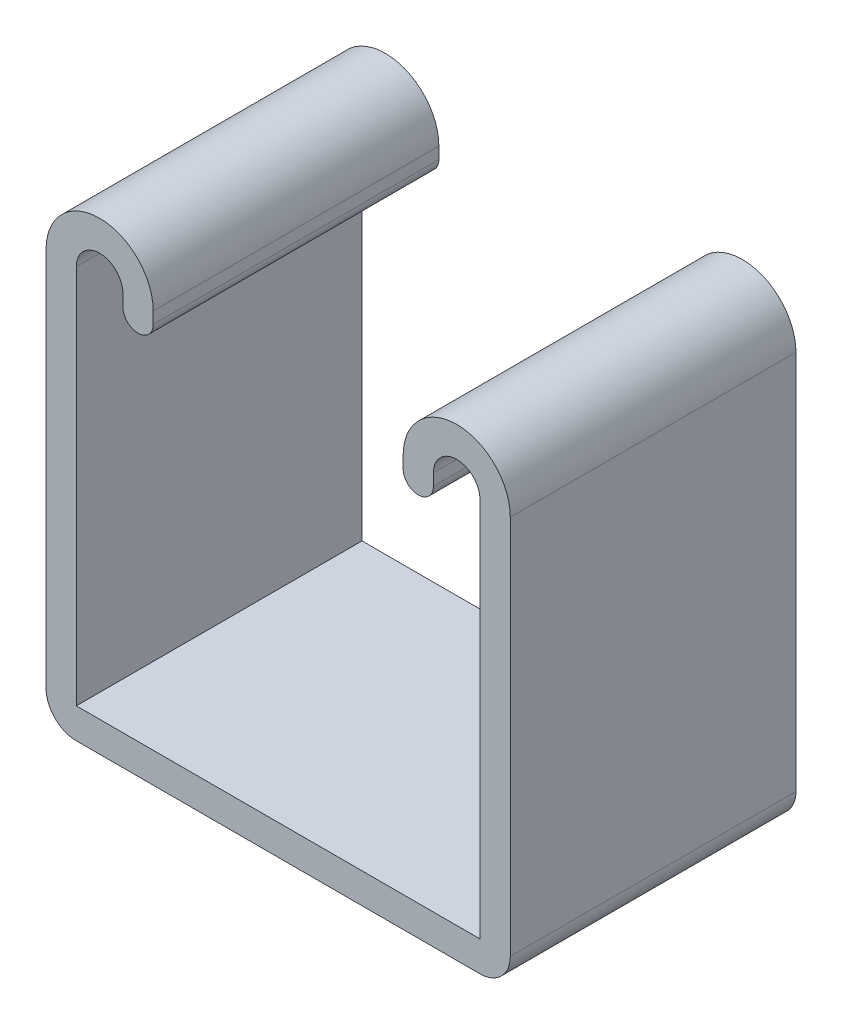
ISO-10303-21;
HEADER;
FILE_DESCRIPTION(('STEP AP214'),'2;1');
FILE_NAME('part.step','',(''),(''),'','','');
FILE_SCHEMA(('AUTOMOTIVE_DESIGN { 1 0 10303 214 1 1 1 1 }'));
ENDSEC;
DATA;
#1=APPLICATION_CONTEXT('core data for automotive mechanical design processes');
#2=APPLICATION_PROTOCOL_DEFINITION('international standard','automotive_design',2000,#1);
#3=PRODUCT_CONTEXT('',#1,'mechanical');
#4=PRODUCT('Part','Part','',(#3));
#5=PRODUCT_RELATED_PRODUCT_CATEGORY('part','',(#4));
#6=PRODUCT_DEFINITION_FORMATION('','',#4);
#7=PRODUCT_DEFINITION_CONTEXT('part definition',#1,'design');
#8=PRODUCT_DEFINITION('design','',#6,#7);
#9=PRODUCT_DEFINITION_SHAPE('','',#8);
#10=(LENGTH_UNIT() NAMED_UNIT(*) SI_UNIT(.MILLI.,.METRE.));
#11=(NAMED_UNIT(*) PLANE_ANGLE_UNIT() SI_UNIT($,.RADIAN.));
#12=(NAMED_UNIT(*) SI_UNIT($,.STERADIAN.) SOLID_ANGLE_UNIT());
#13=UNCERTAINTY_MEASURE_WITH_UNIT(LENGTH_MEASURE(1.E-05),#10,'distance_accuracy_value','');
#14=(GEOMETRIC_REPRESENTATION_CONTEXT(3) GLOBAL_UNCERTAINTY_ASSIGNED_CONTEXT((#13)) GLOBAL_UNIT_ASSIGNED_CONTEXT((#10,
#11,#12)) REPRESENTATION_CONTEXT('',''));
#15=CARTESIAN_POINT('',(0.,0.,0.));
#16=DIRECTION('',(0.,0.,1.));
#17=DIRECTION('',(1.,0.,0.));
#18=AXIS2_PLACEMENT_3D('',#15,#16,#17);
#19=CARTESIAN_POINT('',(-15.875,18.4785,12.7));
#20=DIRECTION('',(0.,0.,-1.));
#21=DIRECTION('',(-1.,0.,0.));
#22=AXIS2_PLACEMENT_3D('',#19,#20,#21);
#23=CYLINDRICAL_SURFACE('',#22,4.7625);
#24=CARTESIAN_POINT('',(-15.875,18.4785,-12.7));
#25=DIRECTION('',(0.,0.,1.));
#26=DIRECTION('',(-1.,0.,0.));
#27=AXIS2_PLACEMENT_3D('',#24,#25,#26);
#28=CIRCLE('',#27,4.7625);
#29=CARTESIAN_POINT('',(-11.1125,18.4785,-12.7));
#30=VERTEX_POINT('',#29);
#31=CARTESIAN_POINT('',(-20.6375,18.4785,-12.7));
#32=VERTEX_POINT('',#31);
#33=EDGE_CURVE('E189',#30,#32,#28,.T.);
#34=ORIENTED_EDGE('',*,*,#33,.T.);
#35=DIRECTION('',(0.,0.,-1.));
#36=VECTOR('',#35,1.);
#37=CARTESIAN_POINT('',(-20.6375,18.4785,12.7));
#38=LINE('',#37,#36);
#39=CARTESIAN_POINT('',(-20.6375,18.4785,12.7));
#40=VERTEX_POINT('',#39);
#41=EDGE_CURVE('E11',#40,#32,#38,.T.);
#42=ORIENTED_EDGE('',*,*,#41,.F.);
#43=CARTESIAN_POINT('',(-15.875,18.4785,12.7));
#44=DIRECTION('',(0.,0.,1.));
#45=DIRECTION('',(-1.,0.,0.));
#46=AXIS2_PLACEMENT_3D('',#43,#44,#45);
#47=CIRCLE('',#46,4.7625);
#48=CARTESIAN_POINT('',(-11.1125,18.4785,12.7));
#49=VERTEX_POINT('',#48);
#50=EDGE_CURVE('E223',#49,#40,#47,.T.);
#51=ORIENTED_EDGE('',*,*,#50,.F.);
#52=DIRECTION('',(0.,0.,-1.));
#53=VECTOR('',#52,1.);
#54=CARTESIAN_POINT('',(-11.1125,18.4785,12.7));
#55=LINE('',#54,#53);
#56=EDGE_CURVE('E185',#49,#30,#55,.T.);
#57=ORIENTED_EDGE('',*,*,#56,.T.);
#58=EDGE_LOOP('',(#34,#42,#51,#57));
#59=FACE_BOUND('',#58,.T.);
#60=ADVANCED_FACE('F33',(#59),#23,.T.);
#61=CARTESIAN_POINT('',(-20.6375,18.4785,12.7));
#62=DIRECTION('',(1.,0.,0.));
#63=DIRECTION('',(0.,1.,0.));
#64=AXIS2_PLACEMENT_3D('',#61,#62,#63);
#65=PLANE('',#64);
#66=DIRECTION('',(0.,-1.,0.));
#67=VECTOR('',#66,1.);
#68=CARTESIAN_POINT('',(-20.6375,18.4785,-12.7));
#69=LINE('',#68,#67);
#70=CARTESIAN_POINT('',(-20.6375,-15.3416,-12.7));
#71=VERTEX_POINT('',#70);
#72=EDGE_CURVE('E192',#32,#71,#69,.T.);
#73=ORIENTED_EDGE('',*,*,#72,.T.);
#74=DIRECTION('',(0.,0.,-1.));
#75=VECTOR('',#74,1.);
#76=CARTESIAN_POINT('',(-20.6375,-15.3416,12.7));
#77=LINE('',#76,#75);
#78=CARTESIAN_POINT('',(-20.6375,-15.3416,12.7));
#79=VERTEX_POINT('',#78);
#80=EDGE_CURVE('E41',#79,#71,#77,.T.);
#81=ORIENTED_EDGE('',*,*,#80,.F.);
#82=DIRECTION('',(0.,-1.,0.));
#83=VECTOR('',#82,1.);
#84=CARTESIAN_POINT('',(-20.6375,18.4785,12.7));
#85=LINE('',#84,#83);
#86=EDGE_CURVE('E122',#40,#79,#85,.T.);
#87=ORIENTED_EDGE('',*,*,#86,.F.);
#88=ORIENTED_EDGE('',*,*,#41,.T.);
#89=EDGE_LOOP('',(#73,#81,#87,#88));
#90=FACE_BOUND('',#89,.T.);
#91=ADVANCED_FACE('F331',(#90),#65,.F.);
#92=CARTESIAN_POINT('',(-17.9451,-15.3416,12.7));
#93=DIRECTION('',(0.,0.,-1.));
#94=DIRECTION('',(-1.,0.,0.));
#95=AXIS2_PLACEMENT_3D('',#92,#93,#94);
#96=CYLINDRICAL_SURFACE('',#95,2.6924);
#97=CARTESIAN_POINT('',(-17.9451,-15.3416,-12.7));
#98=DIRECTION('',(0.,0.,1.));
#99=DIRECTION('',(-1.,0.,0.));
#100=AXIS2_PLACEMENT_3D('',#97,#98,#99);
#101=CIRCLE('',#100,2.6924);
#102=CARTESIAN_POINT('',(-17.9451,-18.034,-12.7));
#103=VERTEX_POINT('',#102);
#104=EDGE_CURVE('E194',#71,#103,#101,.T.);
#105=ORIENTED_EDGE('',*,*,#104,.T.);
#106=DIRECTION('',(0.,0.,-1.));
#107=VECTOR('',#106,1.);
#108=CARTESIAN_POINT('',(-17.9451,-18.034,12.7));
#109=LINE('',#108,#107);
#110=CARTESIAN_POINT('',(-17.9451,-18.034,12.7));
#111=VERTEX_POINT('',#110);
#112=EDGE_CURVE('E260',#111,#103,#109,.T.);
#113=ORIENTED_EDGE('',*,*,#112,.F.);
#114=CARTESIAN_POINT('',(-17.9451,-15.3416,12.7));
#115=DIRECTION('',(0.,0.,1.));
#116=DIRECTION('',(-1.,0.,0.));
#117=AXIS2_PLACEMENT_3D('',#114,#115,#116);
#118=CIRCLE('',#117,2.6924);
#119=EDGE_CURVE('E268',#79,#111,#118,.T.);
#120=ORIENTED_EDGE('',*,*,#119,.F.);
#121=ORIENTED_EDGE('',*,*,#80,.T.);
#122=EDGE_LOOP('',(#105,#113,#120,#121));
#123=FACE_BOUND('',#122,.T.);
#124=ADVANCED_FACE('F266',(#123),#96,.T.);
#125=CARTESIAN_POINT('',(-17.9451,-18.034,12.7));
#126=DIRECTION('',(0.,1.,0.));
#127=DIRECTION('',(-1.,0.,0.));
#128=AXIS2_PLACEMENT_3D('',#125,#126,#127);
#129=PLANE('',#128);
#130=DIRECTION('',(1.,0.,0.));
#131=VECTOR('',#130,1.);
#132=CARTESIAN_POINT('',(-17.9451,-18.034,-12.7));
#133=LINE('',#132,#131);
#134=CARTESIAN_POINT('',(17.9451,-18.034,-12.7));
#135=VERTEX_POINT('',#134);
#136=EDGE_CURVE('E196',#103,#135,#133,.T.);
#137=ORIENTED_EDGE('',*,*,#136,.T.);
#138=DIRECTION('',(0.,0.,-1.));
#139=VECTOR('',#138,1.);
#140=CARTESIAN_POINT('',(17.9451,-18.034,12.7));
#141=LINE('',#140,#139);
#142=CARTESIAN_POINT('',(17.9451,-18.034,12.7));
#143=VERTEX_POINT('',#142);
#144=EDGE_CURVE('E257',#143,#135,#141,.T.);
#145=ORIENTED_EDGE('',*,*,#144,.F.);
#146=DIRECTION('',(1.,0.,0.));
#147=VECTOR('',#146,1.);
#148=CARTESIAN_POINT('',(-17.9451,-18.034,12.7));
#149=LINE('',#148,#147);
#150=EDGE_CURVE('E286',#111,#143,#149,.T.);
#151=ORIENTED_EDGE('',*,*,#150,.F.);
#152=ORIENTED_EDGE('',*,*,#112,.T.);
#153=EDGE_LOOP('',(#137,#145,#151,#152));
#154=FACE_BOUND('',#153,.T.);
#155=ADVANCED_FACE('F277',(#154),#129,.F.);
#156=CARTESIAN_POINT('',(17.9451,-15.3416,12.7));
#157=DIRECTION('',(0.,0.,-1.));
#158=DIRECTION('',(-1.,0.,0.));
#159=AXIS2_PLACEMENT_3D('',#156,#157,#158);
#160=CYLINDRICAL_SURFACE('',#159,2.6924);
#161=CARTESIAN_POINT('',(17.9451,-15.3416,-12.7));
#162=DIRECTION('',(0.,0.,1.));
#163=DIRECTION('',(1.,0.,0.));
#164=AXIS2_PLACEMENT_3D('',#161,#162,#163);
#165=CIRCLE('',#164,2.6924);
#166=CARTESIAN_POINT('',(20.6375,-15.3416,-12.7));
#167=VERTEX_POINT('',#166);
#168=EDGE_CURVE('E198',#135,#167,#165,.T.);
#169=ORIENTED_EDGE('',*,*,#168,.T.);
#170=DIRECTION('',(0.,0.,-1.));
#171=VECTOR('',#170,1.);
#172=CARTESIAN_POINT('',(20.6375,-15.3416,12.7));
#173=LINE('',#172,#171);
#174=CARTESIAN_POINT('',(20.6375,-15.3416,12.7));
#175=VERTEX_POINT('',#174);
#176=EDGE_CURVE('E254',#175,#167,#173,.T.);
#177=ORIENTED_EDGE('',*,*,#176,.F.);
#178=CARTESIAN_POINT('',(17.9451,-15.3416,12.7));
#179=DIRECTION('',(0.,0.,1.));
#180=DIRECTION('',(1.,0.,0.));
#181=AXIS2_PLACEMENT_3D('',#178,#179,#180);
#182=CIRCLE('',#181,2.6924);
#183=EDGE_CURVE('E283',#143,#175,#182,.T.);
#184=ORIENTED_EDGE('',*,*,#183,.F.);
#185=ORIENTED_EDGE('',*,*,#144,.T.);
#186=EDGE_LOOP('',(#169,#177,#184,#185));
#187=FACE_BOUND('',#186,.T.);
#188=ADVANCED_FACE('F281',(#187),#160,.T.);
#189=CARTESIAN_POINT('',(20.6375,-15.3416,12.7));
#190=DIRECTION('',(-1.,0.,0.));
#191=DIRECTION('',(0.,0.,1.));
#192=AXIS2_PLACEMENT_3D('',#189,#190,#191);
#193=PLANE('',#192);
#194=DIRECTION('',(0.,1.,0.));
#195=VECTOR('',#194,1.);
#196=CARTESIAN_POINT('',(20.6375,-15.3416,-12.7));
#197=LINE('',#196,#195);
#198=CARTESIAN_POINT('',(20.6375,18.4785,-12.7));
#199=VERTEX_POINT('',#198);
#200=EDGE_CURVE('E200',#167,#199,#197,.T.);
#201=ORIENTED_EDGE('',*,*,#200,.T.);
#202=DIRECTION('',(0.,0.,-1.));
#203=VECTOR('',#202,1.);
#204=CARTESIAN_POINT('',(20.6375,18.4785,12.7));
#205=LINE('',#204,#203);
#206=CARTESIAN_POINT('',(20.6375,18.4785,12.7));
#207=VERTEX_POINT('',#206);
#208=EDGE_CURVE('E251',#207,#199,#205,.T.);
#209=ORIENTED_EDGE('',*,*,#208,.F.);
#210=DIRECTION('',(0.,1.,0.));
#211=VECTOR('',#210,1.);
#212=CARTESIAN_POINT('',(20.6375,-15.3416,12.7));
#213=LINE('',#212,#211);
#214=EDGE_CURVE('E285',#175,#207,#213,.T.);
#215=ORIENTED_EDGE('',*,*,#214,.F.);
#216=ORIENTED_EDGE('',*,*,#176,.T.);
#217=EDGE_LOOP('',(#201,#209,#215,#216));
#218=FACE_BOUND('',#217,.T.);
#219=ADVANCED_FACE('F344',(#218),#193,.F.);
#220=CARTESIAN_POINT('',(15.875,18.4785,12.7));
#221=DIRECTION('',(0.,0.,-1.));
#222=DIRECTION('',(-1.,0.,0.));
#223=AXIS2_PLACEMENT_3D('',#220,#221,#222);
#224=CYLINDRICAL_SURFACE('',#223,4.7625);
#225=CARTESIAN_POINT('',(15.875,18.4785,-12.7));
#226=DIRECTION('',(0.,0.,1.));
#227=DIRECTION('',(1.,0.,0.));
#228=AXIS2_PLACEMENT_3D('',#225,#226,#227);
#229=CIRCLE('',#228,4.7625);
#230=CARTESIAN_POINT('',(11.1125,18.4785,-12.7));
#231=VERTEX_POINT('',#230);
#232=EDGE_CURVE('E202',#199,#231,#229,.T.);
#233=ORIENTED_EDGE('',*,*,#232,.T.);
#234=DIRECTION('',(0.,0.,-1.));
#235=VECTOR('',#234,1.);
#236=CARTESIAN_POINT('',(11.1125,18.4785,12.7));
#237=LINE('',#236,#235);
#238=CARTESIAN_POINT('',(11.1125,18.4785,12.7));
#239=VERTEX_POINT('',#238);
#240=EDGE_CURVE('E248',#239,#231,#237,.T.);
#241=ORIENTED_EDGE('',*,*,#240,.F.);
#242=CARTESIAN_POINT('',(15.875,18.4785,12.7));
#243=DIRECTION('',(0.,0.,1.));
#244=DIRECTION('',(1.,0.,0.));
#245=AXIS2_PLACEMENT_3D('',#242,#243,#244);
#246=CIRCLE('',#245,4.7625);
#247=EDGE_CURVE('E288',#207,#239,#246,.T.);
#248=ORIENTED_EDGE('',*,*,#247,.F.);
#249=ORIENTED_EDGE('',*,*,#208,.T.);
#250=EDGE_LOOP('',(#233,#241,#248,#249));
#251=FACE_BOUND('',#250,.T.);
#252=ADVANCED_FACE('F347',(#251),#224,.T.);
#253=CARTESIAN_POINT('',(11.1125,18.4785,12.7));
#254=DIRECTION('',(1.,0.,0.));
#255=DIRECTION('',(0.,1.,0.));
#256=AXIS2_PLACEMENT_3D('',#253,#254,#255);
#257=PLANE('',#256);
#258=DIRECTION('',(0.,-1.,0.));
#259=VECTOR('',#258,1.);
#260=CARTESIAN_POINT('',(11.1125,18.4785,-12.7));
#261=LINE('',#260,#259);
#262=CARTESIAN_POINT('',(11.1125,17.44345,-12.7));
#263=VERTEX_POINT('',#262);
#264=EDGE_CURVE('E204',#231,#263,#261,.T.);
#265=ORIENTED_EDGE('',*,*,#264,.T.);
#266=DIRECTION('',(0.,0.,-1.));
#267=VECTOR('',#266,1.);
#268=CARTESIAN_POINT('',(11.1125,17.44345,12.7));
#269=LINE('',#268,#267);
#270=CARTESIAN_POINT('',(11.1125,17.44345,12.7));
#271=VERTEX_POINT('',#270);
#272=EDGE_CURVE('E245',#271,#263,#269,.T.);
#273=ORIENTED_EDGE('',*,*,#272,.F.);
#274=DIRECTION('',(0.,-1.,0.));
#275=VECTOR('',#274,1.);
#276=CARTESIAN_POINT('',(11.1125,18.4785,12.7));
#277=LINE('',#276,#275);
#278=EDGE_CURVE('E294',#239,#271,#277,.T.);
#279=ORIENTED_EDGE('',*,*,#278,.F.);
#280=ORIENTED_EDGE('',*,*,#240,.T.);
#281=EDGE_LOOP('',(#265,#273,#279,#280));
#282=FACE_BOUND('',#281,.T.);
#283=ADVANCED_FACE('F351',(#282),#257,.F.);
#284=CARTESIAN_POINT('',(12.4587,17.44345,12.7));
#285=DIRECTION('',(0.,0.,-1.));
#286=DIRECTION('',(-1.,0.,0.));
#287=AXIS2_PLACEMENT_3D('',#284,#285,#286);
#288=CYLINDRICAL_SURFACE('',#287,1.3462);
#289=CARTESIAN_POINT('',(12.4587,17.44345,-12.7));
#290=DIRECTION('',(0.,0.,1.));
#291=DIRECTION('',(1.,0.,0.));
#292=AXIS2_PLACEMENT_3D('',#289,#290,#291);
#293=CIRCLE('',#292,1.3462);
#294=CARTESIAN_POINT('',(13.8049,17.44345,-12.7));
#295=VERTEX_POINT('',#294);
#296=EDGE_CURVE('E206',#263,#295,#293,.T.);
#297=ORIENTED_EDGE('',*,*,#296,.T.);
#298=DIRECTION('',(0.,0.,-1.));
#299=VECTOR('',#298,1.);
#300=CARTESIAN_POINT('',(13.8049,17.44345,12.7));
#301=LINE('',#300,#299);
#302=CARTESIAN_POINT('',(13.8049,17.44345,12.7));
#303=VERTEX_POINT('',#302);
#304=EDGE_CURVE('E242',#303,#295,#301,.T.);
#305=ORIENTED_EDGE('',*,*,#304,.F.);
#306=CARTESIAN_POINT('',(12.4587,17.44345,12.7));
#307=DIRECTION('',(0.,0.,1.));
#308=DIRECTION('',(1.,0.,0.));
#309=AXIS2_PLACEMENT_3D('',#306,#307,#308);
#310=CIRCLE('',#309,1.3462);
#311=EDGE_CURVE('E296',#271,#303,#310,.T.);
#312=ORIENTED_EDGE('',*,*,#311,.F.);
#313=ORIENTED_EDGE('',*,*,#272,.T.);
#314=EDGE_LOOP('',(#297,#305,#312,#313));
#315=FACE_BOUND('',#314,.T.);
#316=ADVANCED_FACE('F355',(#315),#288,.T.);
#317=CARTESIAN_POINT('',(13.8049,18.4785,12.7));
#318=DIRECTION('',(-1.,0.,0.));
#319=DIRECTION('',(0.,0.,1.));
#320=AXIS2_PLACEMENT_3D('',#317,#318,#319);
#321=PLANE('',#320);
#322=DIRECTION('',(0.,1.,0.));
#323=VECTOR('',#322,1.);
#324=CARTESIAN_POINT('',(13.8049,18.4785,-12.7));
#325=LINE('',#324,#323);
#326=CARTESIAN_POINT('',(13.8049,18.4785,-12.7));
#327=VERTEX_POINT('',#326);
#328=EDGE_CURVE('E208',#295,#327,#325,.T.);
#329=ORIENTED_EDGE('',*,*,#328,.T.);
#330=DIRECTION('',(0.,0.,-1.));
#331=VECTOR('',#330,1.);
#332=CARTESIAN_POINT('',(13.8049,18.4785,12.7));
#333=LINE('',#332,#331);
#334=CARTESIAN_POINT('',(13.8049,18.4785,12.7));
#335=VERTEX_POINT('',#334);
#336=EDGE_CURVE('E239',#335,#327,#333,.T.);
#337=ORIENTED_EDGE('',*,*,#336,.F.);
#338=DIRECTION('',(0.,1.,0.));
#339=VECTOR('',#338,1.);
#340=CARTESIAN_POINT('',(13.8049,18.4785,12.7));
#341=LINE('',#340,#339);
#342=EDGE_CURVE('E298',#303,#335,#341,.T.);
#343=ORIENTED_EDGE('',*,*,#342,.F.);
#344=ORIENTED_EDGE('',*,*,#304,.T.);
#345=EDGE_LOOP('',(#329,#337,#343,#344));
#346=FACE_BOUND('',#345,.T.);
#347=ADVANCED_FACE('F359',(#346),#321,.F.);
#348=CARTESIAN_POINT('',(15.875,18.4785,12.7));
#349=DIRECTION('',(0.,0.,-1.));
#350=DIRECTION('',(-1.,0.,0.));
#351=AXIS2_PLACEMENT_3D('',#348,#349,#350);
#352=CYLINDRICAL_SURFACE('',#351,2.0701);
#353=CARTESIAN_POINT('',(15.875,18.4785,-12.7));
#354=DIRECTION('',(0.,0.,-1.));
#355=DIRECTION('',(1.,0.,0.));
#356=AXIS2_PLACEMENT_3D('',#353,#354,#355);
#357=CIRCLE('',#356,2.0701);
#358=CARTESIAN_POINT('',(17.9451,18.4785,-12.7));
#359=VERTEX_POINT('',#358);
#360=EDGE_CURVE('E210',#327,#359,#357,.T.);
#361=ORIENTED_EDGE('',*,*,#360,.T.);
#362=DIRECTION('',(0.,0.,-1.));
#363=VECTOR('',#362,1.);
#364=CARTESIAN_POINT('',(17.9451,18.4785,12.7));
#365=LINE('',#364,#363);
#366=CARTESIAN_POINT('',(17.9451,18.4785,12.7));
#367=VERTEX_POINT('',#366);
#368=EDGE_CURVE('E236',#367,#359,#365,.T.);
#369=ORIENTED_EDGE('',*,*,#368,.F.);
#370=CARTESIAN_POINT('',(15.875,18.4785,12.7));
#371=DIRECTION('',(0.,0.,-1.));
#372=DIRECTION('',(1.,0.,0.));
#373=AXIS2_PLACEMENT_3D('',#370,#371,#372);
#374=CIRCLE('',#373,2.0701);
#375=EDGE_CURVE('E300',#335,#367,#374,.T.);
#376=ORIENTED_EDGE('',*,*,#375,.F.);
#377=ORIENTED_EDGE('',*,*,#336,.T.);
#378=EDGE_LOOP('',(#361,#369,#376,#377));
#379=FACE_BOUND('',#378,.T.);
#380=ADVANCED_FACE('F363',(#379),#352,.F.);
#381=CARTESIAN_POINT('',(17.9451,-15.3416,12.7));
#382=DIRECTION('',(1.,0.,0.));
#383=DIRECTION('',(0.,1.,0.));
#384=AXIS2_PLACEMENT_3D('',#381,#382,#383);
#385=PLANE('',#384);
#386=DIRECTION('',(0.,-1.,0.));
#387=VECTOR('',#386,1.);
#388=CARTESIAN_POINT('',(17.9451,-15.3416,-12.7));
#389=LINE('',#388,#387);
#390=CARTESIAN_POINT('',(17.9451,-15.3416,-12.7));
#391=VERTEX_POINT('',#390);
#392=EDGE_CURVE('E212',#359,#391,#389,.T.);
#393=ORIENTED_EDGE('',*,*,#392,.T.);
#394=DIRECTION('',(0.,0.,-1.));
#395=VECTOR('',#394,1.);
#396=CARTESIAN_POINT('',(17.9451,-15.3416,12.7));
#397=LINE('',#396,#395);
#398=CARTESIAN_POINT('',(17.9451,-15.3416,12.7));
#399=VERTEX_POINT('',#398);
#400=EDGE_CURVE('E233',#399,#391,#397,.T.);
#401=ORIENTED_EDGE('',*,*,#400,.F.);
#402=DIRECTION('',(0.,-1.,0.));
#403=VECTOR('',#402,1.);
#404=CARTESIAN_POINT('',(17.9451,-15.3416,12.7));
#405=LINE('',#404,#403);
#406=EDGE_CURVE('E302',#367,#399,#405,.T.);
#407=ORIENTED_EDGE('',*,*,#406,.F.);
#408=ORIENTED_EDGE('',*,*,#368,.T.);
#409=EDGE_LOOP('',(#393,#401,#407,#408));
#410=FACE_BOUND('',#409,.T.);
#411=ADVANCED_FACE('F367',(#410),#385,.F.);
#412=CARTESIAN_POINT('',(-17.9451,-15.3416,12.7));
#413=DIRECTION('',(0.,-1.,0.));
#414=DIRECTION('',(1.,0.,0.));
#415=AXIS2_PLACEMENT_3D('',#412,#413,#414);
#416=PLANE('',#415);
#417=DIRECTION('',(-1.,0.,0.));
#418=VECTOR('',#417,1.);
#419=CARTESIAN_POINT('',(-17.9451,-15.3416,-12.7));
#420=LINE('',#419,#418);
#421=CARTESIAN_POINT('',(-17.9451,-15.3416,-12.7));
#422=VERTEX_POINT('',#421);
#423=EDGE_CURVE('E214',#391,#422,#420,.T.);
#424=ORIENTED_EDGE('',*,*,#423,.T.);
#425=DIRECTION('',(0.,0.,-1.));
#426=VECTOR('',#425,1.);
#427=CARTESIAN_POINT('',(-17.9451,-15.3416,12.7));
#428=LINE('',#427,#426);
#429=CARTESIAN_POINT('',(-17.9451,-15.3416,12.7));
#430=VERTEX_POINT('',#429);
#431=EDGE_CURVE('E230',#430,#422,#428,.T.);
#432=ORIENTED_EDGE('',*,*,#431,.F.);
#433=DIRECTION('',(-1.,0.,0.));
#434=VECTOR('',#433,1.);
#435=CARTESIAN_POINT('',(-17.9451,-15.3416,12.7));
#436=LINE('',#435,#434);
#437=EDGE_CURVE('E304',#399,#430,#436,.T.);
#438=ORIENTED_EDGE('',*,*,#437,.F.);
#439=ORIENTED_EDGE('',*,*,#400,.T.);
#440=EDGE_LOOP('',(#424,#432,#438,#439));
#441=FACE_BOUND('',#440,.T.);
#442=ADVANCED_FACE('F371',(#441),#416,.F.);
#443=CARTESIAN_POINT('',(-17.9451,18.4785,12.7));
#444=DIRECTION('',(-1.,0.,0.));
#445=DIRECTION('',(0.,-1.,0.));
#446=AXIS2_PLACEMENT_3D('',#443,#444,#445);
#447=PLANE('',#446);
#448=DIRECTION('',(0.,1.,0.));
#449=VECTOR('',#448,1.);
#450=CARTESIAN_POINT('',(-17.9451,18.4785,-12.7));
#451=LINE('',#450,#449);
#452=CARTESIAN_POINT('',(-17.9451,18.4785,-12.7));
#453=VERTEX_POINT('',#452);
#454=EDGE_CURVE('E216',#422,#453,#451,.T.);
#455=ORIENTED_EDGE('',*,*,#454,.T.);
#456=DIRECTION('',(0.,0.,-1.));
#457=VECTOR('',#456,1.);
#458=CARTESIAN_POINT('',(-17.9451,18.4785,12.7));
#459=LINE('',#458,#457);
#460=CARTESIAN_POINT('',(-17.9451,18.4785,12.7));
#461=VERTEX_POINT('',#460);
#462=EDGE_CURVE('E227',#461,#453,#459,.T.);
#463=ORIENTED_EDGE('',*,*,#462,.F.);
#464=DIRECTION('',(0.,1.,0.));
#465=VECTOR('',#464,1.);
#466=CARTESIAN_POINT('',(-17.9451,18.4785,12.7));
#467=LINE('',#466,#465);
#468=EDGE_CURVE('E306',#430,#461,#467,.T.);
#469=ORIENTED_EDGE('',*,*,#468,.F.);
#470=ORIENTED_EDGE('',*,*,#431,.T.);
#471=EDGE_LOOP('',(#455,#463,#469,#470));
#472=FACE_BOUND('',#471,.T.);
#473=ADVANCED_FACE('F312',(#472),#447,.F.);
#474=CARTESIAN_POINT('',(-15.875,18.4785,12.7));
#475=DIRECTION('',(0.,0.,-1.));
#476=DIRECTION('',(-1.,0.,0.));
#477=AXIS2_PLACEMENT_3D('',#474,#475,#476);
#478=CYLINDRICAL_SURFACE('',#477,2.0701);
#479=CARTESIAN_POINT('',(-15.875,18.4785,-12.7));
#480=DIRECTION('',(0.,0.,-1.));
#481=DIRECTION('',(-1.,0.,0.));
#482=AXIS2_PLACEMENT_3D('',#479,#480,#481);
#483=CIRCLE('',#482,2.0701);
#484=CARTESIAN_POINT('',(-13.8049,18.4785,-12.7));
#485=VERTEX_POINT('',#484);
#486=EDGE_CURVE('E218',#453,#485,#483,.T.);
#487=ORIENTED_EDGE('',*,*,#486,.T.);
#488=DIRECTION('',(0.,0.,-1.));
#489=VECTOR('',#488,1.);
#490=CARTESIAN_POINT('',(-13.8049,18.4785,12.7));
#491=LINE('',#490,#489);
#492=CARTESIAN_POINT('',(-13.8049,18.4785,12.7));
#493=VERTEX_POINT('',#492);
#494=EDGE_CURVE('E180',#493,#485,#491,.T.);
#495=ORIENTED_EDGE('',*,*,#494,.F.);
#496=CARTESIAN_POINT('',(-15.875,18.4785,12.7));
#497=DIRECTION('',(0.,0.,-1.));
#498=DIRECTION('',(-1.,0.,0.));
#499=AXIS2_PLACEMENT_3D('',#496,#497,#498);
#500=CIRCLE('',#499,2.0701);
#501=EDGE_CURVE('E171',#461,#493,#500,.T.);
#502=ORIENTED_EDGE('',*,*,#501,.F.);
#503=ORIENTED_EDGE('',*,*,#462,.T.);
#504=EDGE_LOOP('',(#487,#495,#502,#503));
#505=FACE_BOUND('',#504,.T.);
#506=ADVANCED_FACE('F316',(#505),#478,.F.);
#507=CARTESIAN_POINT('',(-13.8049,18.4785,12.7));
#508=DIRECTION('',(1.,0.,0.));
#509=DIRECTION('',(0.,1.,0.));
#510=AXIS2_PLACEMENT_3D('',#507,#508,#509);
#511=PLANE('',#510);
#512=DIRECTION('',(0.,-1.,0.));
#513=VECTOR('',#512,1.);
#514=CARTESIAN_POINT('',(-13.8049,18.4785,-12.7));
#515=LINE('',#514,#513);
#516=CARTESIAN_POINT('',(-13.8049,17.44345,-12.7));
#517=VERTEX_POINT('',#516);
#518=EDGE_CURVE('E179',#485,#517,#515,.T.);
#519=ORIENTED_EDGE('',*,*,#518,.T.);
#520=DIRECTION('',(0.,0.,-1.));
#521=VECTOR('',#520,1.);
#522=CARTESIAN_POINT('',(-13.8049,17.44345,12.7));
#523=LINE('',#522,#521);
#524=CARTESIAN_POINT('',(-13.8049,17.44345,12.7));
#525=VERTEX_POINT('',#524);
#526=EDGE_CURVE('E176',#525,#517,#523,.T.);
#527=ORIENTED_EDGE('',*,*,#526,.F.);
#528=DIRECTION('',(0.,-1.,0.));
#529=VECTOR('',#528,1.);
#530=CARTESIAN_POINT('',(-13.8049,18.4785,12.7));
#531=LINE('',#530,#529);
#532=EDGE_CURVE('E165',#493,#525,#531,.T.);
#533=ORIENTED_EDGE('',*,*,#532,.F.);
#534=ORIENTED_EDGE('',*,*,#494,.T.);
#535=EDGE_LOOP('',(#519,#527,#533,#534));
#536=FACE_BOUND('',#535,.T.);
#537=ADVANCED_FACE('F177',(#536),#511,.F.);
#538=CARTESIAN_POINT('',(-12.4587,17.44345,12.7));
#539=DIRECTION('',(0.,0.,-1.));
#540=DIRECTION('',(-1.,0.,0.));
#541=AXIS2_PLACEMENT_3D('',#538,#539,#540);
#542=CYLINDRICAL_SURFACE('',#541,1.3462);
#543=CARTESIAN_POINT('',(-12.4587,17.44345,-12.7));
#544=DIRECTION('',(0.,0.,1.));
#545=DIRECTION('',(-1.,0.,0.));
#546=AXIS2_PLACEMENT_3D('',#543,#544,#545);
#547=CIRCLE('',#546,1.3462);
#548=CARTESIAN_POINT('',(-11.1125,17.44345,-12.7));
#549=VERTEX_POINT('',#548);
#550=EDGE_CURVE('E108',#517,#549,#547,.T.);
#551=ORIENTED_EDGE('',*,*,#550,.T.);
#552=DIRECTION('',(0.,0.,-1.));
#553=VECTOR('',#552,1.);
#554=CARTESIAN_POINT('',(-11.1125,17.44345,12.7));
#555=LINE('',#554,#553);
#556=CARTESIAN_POINT('',(-11.1125,17.44345,12.7));
#557=VERTEX_POINT('',#556);
#558=EDGE_CURVE('E181',#557,#549,#555,.T.);
#559=ORIENTED_EDGE('',*,*,#558,.F.);
#560=CARTESIAN_POINT('',(-12.4587,17.44345,12.7));
#561=DIRECTION('',(0.,0.,1.));
#562=DIRECTION('',(-1.,0.,0.));
#563=AXIS2_PLACEMENT_3D('',#560,#561,#562);
#564=CIRCLE('',#563,1.3462);
#565=EDGE_CURVE('E169',#525,#557,#564,.T.);
#566=ORIENTED_EDGE('',*,*,#565,.F.);
#567=ORIENTED_EDGE('',*,*,#526,.T.);
#568=EDGE_LOOP('',(#551,#559,#566,#567));
#569=FACE_BOUND('',#568,.T.);
#570=ADVANCED_FACE('F183',(#569),#542,.T.);
#571=CARTESIAN_POINT('',(-11.1125,18.4785,12.7));
#572=DIRECTION('',(-1.,0.,0.));
#573=DIRECTION('',(0.,0.,1.));
#574=AXIS2_PLACEMENT_3D('',#571,#572,#573);
#575=PLANE('',#574);
#576=DIRECTION('',(0.,1.,0.));
#577=VECTOR('',#576,1.);
#578=CARTESIAN_POINT('',(-11.1125,18.4785,-12.7));
#579=LINE('',#578,#577);
#580=EDGE_CURVE('E114',#549,#30,#579,.T.);
#581=ORIENTED_EDGE('',*,*,#580,.T.);
#582=ORIENTED_EDGE('',*,*,#56,.F.);
#583=DIRECTION('',(0.,1.,0.));
#584=VECTOR('',#583,1.);
#585=CARTESIAN_POINT('',(-11.1125,18.4785,12.7));
#586=LINE('',#585,#584);
#587=EDGE_CURVE('E49',#557,#49,#586,.T.);
#588=ORIENTED_EDGE('',*,*,#587,.F.);
#589=ORIENTED_EDGE('',*,*,#558,.T.);
#590=EDGE_LOOP('',(#581,#582,#588,#589));
#591=FACE_BOUND('',#590,.T.);
#592=ADVANCED_FACE('F320',(#591),#575,.F.);
#593=CARTESIAN_POINT('',(-15.875,18.4785,12.7));
#594=DIRECTION('',(0.,0.,-1.));
#595=DIRECTION('',(-1.,0.,0.));
#596=AXIS2_PLACEMENT_3D('',#593,#594,#595);
#597=PLANE('',#596);
#598=ORIENTED_EDGE('',*,*,#50,.T.);
#599=ORIENTED_EDGE('',*,*,#86,.T.);
#600=ORIENTED_EDGE('',*,*,#119,.T.);
#601=ORIENTED_EDGE('',*,*,#150,.T.);
#602=ORIENTED_EDGE('',*,*,#183,.T.);
#603=ORIENTED_EDGE('',*,*,#214,.T.);
#604=ORIENTED_EDGE('',*,*,#247,.T.);
#605=ORIENTED_EDGE('',*,*,#278,.T.);
#606=ORIENTED_EDGE('',*,*,#311,.T.);
#607=ORIENTED_EDGE('',*,*,#342,.T.);
#608=ORIENTED_EDGE('',*,*,#375,.T.);
#609=ORIENTED_EDGE('',*,*,#406,.T.);
#610=ORIENTED_EDGE('',*,*,#437,.T.);
#611=ORIENTED_EDGE('',*,*,#468,.T.);
#612=ORIENTED_EDGE('',*,*,#501,.T.);
#613=ORIENTED_EDGE('',*,*,#532,.T.);
#614=ORIENTED_EDGE('',*,*,#565,.T.);
#615=ORIENTED_EDGE('',*,*,#587,.T.);
#616=EDGE_LOOP('',(#598,#599,#600,#601,#602,#603,#604,#605,#606,#607,#608,#609,#610,#611,#612,
#613,#614,#615));
#617=FACE_BOUND('',#616,.T.);
#618=ADVANCED_FACE('F167',(#617),#597,.F.);
#619=CARTESIAN_POINT('',(-15.875,18.4785,-12.7));
#620=DIRECTION('',(0.,0.,-1.));
#621=DIRECTION('',(-1.,0.,0.));
#622=AXIS2_PLACEMENT_3D('',#619,#620,#621);
#623=PLANE('',#622);
#624=ORIENTED_EDGE('',*,*,#33,.F.);
#625=ORIENTED_EDGE('',*,*,#580,.F.);
#626=ORIENTED_EDGE('',*,*,#550,.F.);
#627=ORIENTED_EDGE('',*,*,#518,.F.);
#628=ORIENTED_EDGE('',*,*,#486,.F.);
#629=ORIENTED_EDGE('',*,*,#454,.F.);
#630=ORIENTED_EDGE('',*,*,#423,.F.);
#631=ORIENTED_EDGE('',*,*,#392,.F.);
#632=ORIENTED_EDGE('',*,*,#360,.F.);
#633=ORIENTED_EDGE('',*,*,#328,.F.);
#634=ORIENTED_EDGE('',*,*,#296,.F.);
#635=ORIENTED_EDGE('',*,*,#264,.F.);
#636=ORIENTED_EDGE('',*,*,#232,.F.);
#637=ORIENTED_EDGE('',*,*,#200,.F.);
#638=ORIENTED_EDGE('',*,*,#168,.F.);
#639=ORIENTED_EDGE('',*,*,#136,.F.);
#640=ORIENTED_EDGE('',*,*,#104,.F.);
#641=ORIENTED_EDGE('',*,*,#72,.F.);
#642=EDGE_LOOP('',(#624,#625,#626,#627,#628,#629,#630,#631,#632,#633,#634,#635,#636,#637,#638,
#639,#640,#641));
#643=FACE_BOUND('',#642,.T.);
#644=ADVANCED_FACE('F272',(#643),#623,.T.);
#645=CLOSED_SHELL('',(#60,#91,#124,#155,#188,#219,#252,#283,#316,#347,#380,#411,#442,#473,#506,
#537,#570,#592,#618,#644));
#646=MANIFOLD_SOLID_BREP('B2',#645);
#647=ADVANCED_BREP_SHAPE_REPRESENTATION('',(#18,#646),#14);
#648=SHAPE_DEFINITION_REPRESENTATION(#9,#647);
ENDSEC;
END-ISO-10303-21;
